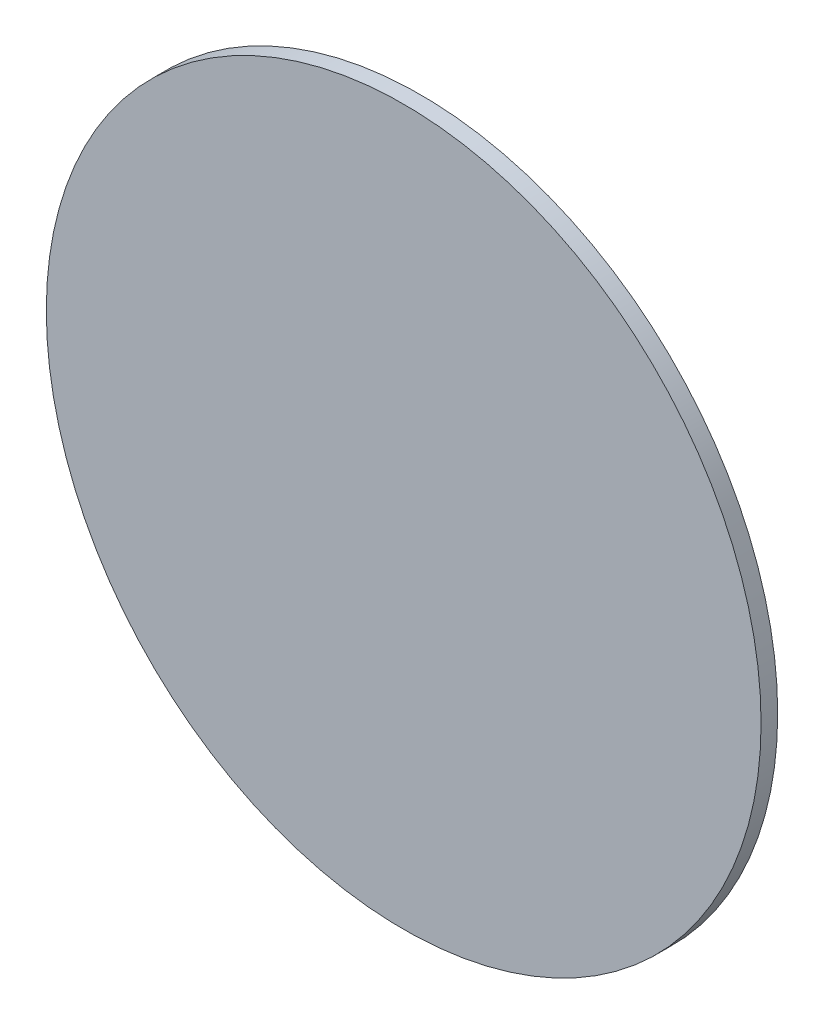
ISO-10303-21;
HEADER;
FILE_DESCRIPTION(('STEP AP214'),'2;1');
FILE_NAME('part.step','',(''),(''),'','','');
FILE_SCHEMA(('AUTOMOTIVE_DESIGN { 1 0 10303 214 1 1 1 1 }'));
ENDSEC;
DATA;
#1=APPLICATION_CONTEXT('core data for automotive mechanical design processes');
#2=APPLICATION_PROTOCOL_DEFINITION('international standard','automotive_design',2000,#1);
#3=PRODUCT_CONTEXT('',#1,'mechanical');
#4=PRODUCT('Part','Part','',(#3));
#5=PRODUCT_RELATED_PRODUCT_CATEGORY('part','',(#4));
#6=PRODUCT_DEFINITION_FORMATION('','',#4);
#7=PRODUCT_DEFINITION_CONTEXT('part definition',#1,'design');
#8=PRODUCT_DEFINITION('design','',#6,#7);
#9=PRODUCT_DEFINITION_SHAPE('','',#8);
#10=(LENGTH_UNIT() NAMED_UNIT(*) SI_UNIT(.MILLI.,.METRE.));
#11=(NAMED_UNIT(*) PLANE_ANGLE_UNIT() SI_UNIT($,.RADIAN.));
#12=(NAMED_UNIT(*) SI_UNIT($,.STERADIAN.) SOLID_ANGLE_UNIT());
#13=UNCERTAINTY_MEASURE_WITH_UNIT(LENGTH_MEASURE(1.E-05),#10,'distance_accuracy_value','');
#14=(GEOMETRIC_REPRESENTATION_CONTEXT(3) GLOBAL_UNCERTAINTY_ASSIGNED_CONTEXT((#13)) GLOBAL_UNIT_ASSIGNED_CONTEXT((#10,
#11,#12)) REPRESENTATION_CONTEXT('',''));
#15=CARTESIAN_POINT('',(0.,0.,0.));
#16=DIRECTION('',(0.,0.,1.));
#17=DIRECTION('',(1.,0.,0.));
#18=AXIS2_PLACEMENT_3D('',#15,#16,#17);
#19=CARTESIAN_POINT('',(0.,0.,5.));
#20=DIRECTION('',(0.,0.,-1.));
#21=DIRECTION('',(-1.,0.,0.));
#22=AXIS2_PLACEMENT_3D('',#19,#20,#21);
#23=CYLINDRICAL_SURFACE('',#22,107.5);
#24=CARTESIAN_POINT('',(0.,0.,5.));
#25=DIRECTION('',(0.,0.,1.));
#26=DIRECTION('',(1.,0.,0.));
#27=AXIS2_PLACEMENT_3D('',#24,#25,#26);
#28=CIRCLE('',#27,107.5);
#29=CARTESIAN_POINT('',(107.5,0.,5.));
#30=VERTEX_POINT('',#29);
#31=EDGE_CURVE('E10',#30,#30,#28,.T.);
#32=ORIENTED_EDGE('',*,*,#31,.F.);
#33=EDGE_LOOP('',(#32));
#34=FACE_BOUND('',#33,.T.);
#35=CARTESIAN_POINT('',(0.,0.,0.));
#36=DIRECTION('',(0.,0.,1.));
#37=DIRECTION('',(1.,0.,0.));
#38=AXIS2_PLACEMENT_3D('',#35,#36,#37);
#39=CIRCLE('',#38,107.5);
#40=CARTESIAN_POINT('',(107.5,0.,0.));
#41=VERTEX_POINT('',#40);
#42=EDGE_CURVE('E33',#41,#41,#39,.T.);
#43=ORIENTED_EDGE('',*,*,#42,.T.);
#44=EDGE_LOOP('',(#43));
#45=FACE_BOUND('',#44,.T.);
#46=ADVANCED_FACE('F27',(#34,#45),#23,.T.);
#47=CARTESIAN_POINT('',(0.,0.,5.));
#48=DIRECTION('',(0.,0.,1.));
#49=DIRECTION('',(1.,0.,0.));
#50=AXIS2_PLACEMENT_3D('',#47,#48,#49);
#51=PLANE('',#50);
#52=ORIENTED_EDGE('',*,*,#31,.T.);
#53=EDGE_LOOP('',(#52));
#54=FACE_BOUND('',#53,.T.);
#55=ADVANCED_FACE('F42',(#54),#51,.T.);
#56=CARTESIAN_POINT('',(0.,0.,0.));
#57=DIRECTION('',(0.,0.,1.));
#58=DIRECTION('',(1.,0.,0.));
#59=AXIS2_PLACEMENT_3D('',#56,#57,#58);
#60=PLANE('',#59);
#61=ORIENTED_EDGE('',*,*,#42,.F.);
#62=EDGE_LOOP('',(#61));
#63=FACE_BOUND('',#62,.T.);
#64=ADVANCED_FACE('F40',(#63),#60,.F.);
#65=CLOSED_SHELL('',(#46,#55,#64));
#66=MANIFOLD_SOLID_BREP('B2',#65);
#67=ADVANCED_BREP_SHAPE_REPRESENTATION('',(#18,#66),#14);
#68=SHAPE_DEFINITION_REPRESENTATION(#9,#67);
ENDSEC;
END-ISO-10303-21;
